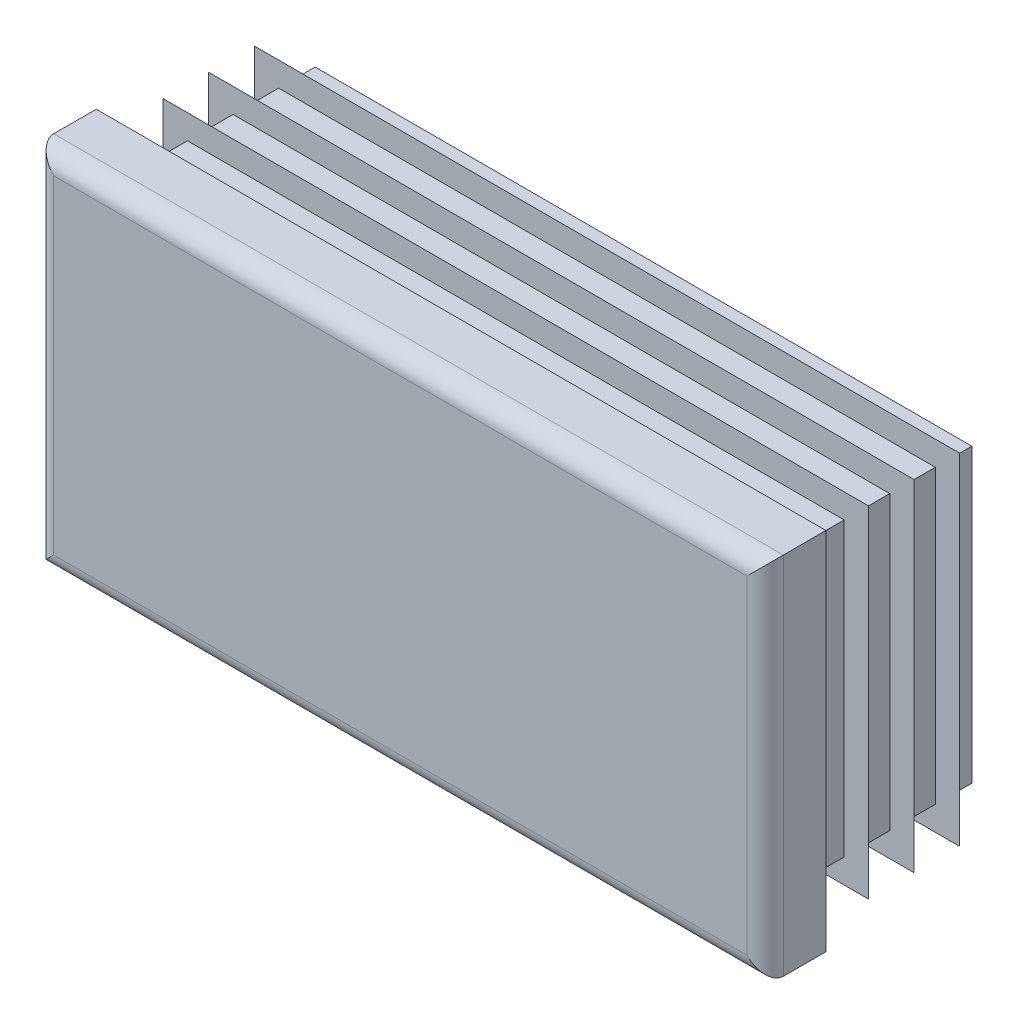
ISO-10303-21;
HEADER;
FILE_DESCRIPTION(('STEP AP214'),'2;1');
FILE_NAME('part.step','',(''),(''),'','','');
FILE_SCHEMA(('AUTOMOTIVE_DESIGN { 1 0 10303 214 1 1 1 1 }'));
ENDSEC;
DATA;
#1=APPLICATION_CONTEXT('core data for automotive mechanical design processes');
#2=APPLICATION_PROTOCOL_DEFINITION('international standard','automotive_design',2000,#1);
#3=PRODUCT_CONTEXT('',#1,'mechanical');
#4=PRODUCT('Part','Part','',(#3));
#5=PRODUCT_RELATED_PRODUCT_CATEGORY('part','',(#4));
#6=PRODUCT_DEFINITION_FORMATION('','',#4);
#7=PRODUCT_DEFINITION_CONTEXT('part definition',#1,'design');
#8=PRODUCT_DEFINITION('design','',#6,#7);
#9=PRODUCT_DEFINITION_SHAPE('','',#8);
#10=(LENGTH_UNIT() NAMED_UNIT(*) SI_UNIT(.MILLI.,.METRE.));
#11=(NAMED_UNIT(*) PLANE_ANGLE_UNIT() SI_UNIT($,.RADIAN.));
#12=(NAMED_UNIT(*) SI_UNIT($,.STERADIAN.) SOLID_ANGLE_UNIT());
#13=UNCERTAINTY_MEASURE_WITH_UNIT(LENGTH_MEASURE(1.E-05),#10,'distance_accuracy_value','');
#14=(GEOMETRIC_REPRESENTATION_CONTEXT(3) GLOBAL_UNCERTAINTY_ASSIGNED_CONTEXT((#13)) GLOBAL_UNIT_ASSIGNED_CONTEXT((#10,
#11,#12)) REPRESENTATION_CONTEXT('',''));
#15=CARTESIAN_POINT('',(0.,0.,0.));
#16=DIRECTION('',(0.,0.,1.));
#17=DIRECTION('',(1.,0.,0.));
#18=AXIS2_PLACEMENT_3D('',#15,#16,#17);
#19=CARTESIAN_POINT('',(28.5,-15.,5.));
#20=DIRECTION('',(0.,0.,-1.));
#21=DIRECTION('',(0.,1.,0.));
#22=AXIS2_PLACEMENT_3D('',#19,#20,#21);
#23=PLANE('',#22);
#24=DIRECTION('',(0.,1.,0.));
#25=VECTOR('',#24,1.);
#26=CARTESIAN_POINT('',(-28.5,-15.,5.));
#27=LINE('',#26,#25);
#28=CARTESIAN_POINT('',(-28.5,-13.5,5.));
#29=VERTEX_POINT('',#28);
#30=CARTESIAN_POINT('',(-28.5,13.5,5.));
#31=VERTEX_POINT('',#30);
#32=EDGE_CURVE('E310',#29,#31,#27,.T.);
#33=ORIENTED_EDGE('',*,*,#32,.F.);
#34=DIRECTION('',(-1.,0.,0.));
#35=VECTOR('',#34,1.);
#36=CARTESIAN_POINT('',(30.,-13.5,5.));
#37=LINE('',#36,#35);
#38=CARTESIAN_POINT('',(28.5,-13.5,5.));
#39=VERTEX_POINT('',#38);
#40=EDGE_CURVE('E482',#39,#29,#37,.T.);
#41=ORIENTED_EDGE('',*,*,#40,.F.);
#42=DIRECTION('',(0.,1.,0.));
#43=VECTOR('',#42,1.);
#44=CARTESIAN_POINT('',(28.5,-15.,5.));
#45=LINE('',#44,#43);
#46=CARTESIAN_POINT('',(28.5,13.5,5.));
#47=VERTEX_POINT('',#46);
#48=EDGE_CURVE('E305',#39,#47,#45,.T.);
#49=ORIENTED_EDGE('',*,*,#48,.T.);
#50=DIRECTION('',(-1.,0.,0.));
#51=VECTOR('',#50,1.);
#52=CARTESIAN_POINT('',(30.,13.5,5.));
#53=LINE('',#52,#51);
#54=EDGE_CURVE('E630',#47,#31,#53,.T.);
#55=ORIENTED_EDGE('',*,*,#54,.T.);
#56=EDGE_LOOP('',(#33,#41,#49,#55));
#57=FACE_BOUND('',#56,.T.);
#58=ADVANCED_FACE('F14',(#57),#23,.F.);
#59=CARTESIAN_POINT('',(-28.5,-15.,3.5));
#60=DIRECTION('',(0.,1.,0.));
#61=DIRECTION('',(-1.,0.,0.));
#62=AXIS2_PLACEMENT_3D('',#59,#60,#61);
#63=CYLINDRICAL_SURFACE('',#62,1.5);
#64=DIRECTION('',(0.,1.,0.));
#65=VECTOR('',#64,1.);
#66=CARTESIAN_POINT('',(-30.,-15.,3.5));
#67=LINE('',#66,#65);
#68=CARTESIAN_POINT('',(-30.,-15.,3.5));
#69=VERTEX_POINT('',#68);
#70=CARTESIAN_POINT('',(-30.,15.,3.5));
#71=VERTEX_POINT('',#70);
#72=EDGE_CURVE('E402',#69,#71,#67,.T.);
#73=ORIENTED_EDGE('',*,*,#72,.F.);
#74=CARTESIAN_POINT('',(-28.5,-13.5,3.5));
#75=DIRECTION('',(-0.707106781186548,0.707106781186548,0.));
#76=DIRECTION('',(0.707106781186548,0.707106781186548,0.));
#77=AXIS2_PLACEMENT_3D('',#74,#75,#76);
#78=ELLIPSE('',#77,2.12132034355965,1.5);
#79=EDGE_CURVE('E59',#69,#29,#78,.T.);
#80=ORIENTED_EDGE('',*,*,#79,.T.);
#81=ORIENTED_EDGE('',*,*,#32,.T.);
#82=CARTESIAN_POINT('',(-28.5,13.5,3.5));
#83=DIRECTION('',(0.707106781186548,0.707106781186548,0.));
#84=DIRECTION('',(-0.707106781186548,0.707106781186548,0.));
#85=AXIS2_PLACEMENT_3D('',#82,#83,#84);
#86=ELLIPSE('',#85,2.12132034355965,1.5);
#87=EDGE_CURVE('E306',#31,#71,#86,.F.);
#88=ORIENTED_EDGE('',*,*,#87,.T.);
#89=EDGE_LOOP('',(#73,#80,#81,#88));
#90=FACE_BOUND('',#89,.T.);
#91=ADVANCED_FACE('F16',(#90),#63,.T.);
#92=CARTESIAN_POINT('',(-30.,-15.,3.5));
#93=DIRECTION('',(1.,0.,0.));
#94=DIRECTION('',(0.,1.,0.));
#95=AXIS2_PLACEMENT_3D('',#92,#93,#94);
#96=PLANE('',#95);
#97=DIRECTION('',(0.,0.,-1.));
#98=VECTOR('',#97,1.);
#99=CARTESIAN_POINT('',(-30.,15.,3.5));
#100=LINE('',#99,#98);
#101=CARTESIAN_POINT('',(-30.,15.,0.));
#102=VERTEX_POINT('',#101);
#103=EDGE_CURVE('E615',#71,#102,#100,.T.);
#104=ORIENTED_EDGE('',*,*,#103,.T.);
#105=DIRECTION('',(0.,1.,0.));
#106=VECTOR('',#105,1.);
#107=CARTESIAN_POINT('',(-30.,-15.,0.));
#108=LINE('',#107,#106);
#109=CARTESIAN_POINT('',(-30.,-15.,0.));
#110=VERTEX_POINT('',#109);
#111=EDGE_CURVE('E400',#110,#102,#108,.T.);
#112=ORIENTED_EDGE('',*,*,#111,.F.);
#113=DIRECTION('',(0.,0.,-1.));
#114=VECTOR('',#113,1.);
#115=CARTESIAN_POINT('',(-30.,-15.,3.5));
#116=LINE('',#115,#114);
#117=EDGE_CURVE('E616',#69,#110,#116,.T.);
#118=ORIENTED_EDGE('',*,*,#117,.F.);
#119=ORIENTED_EDGE('',*,*,#72,.T.);
#120=EDGE_LOOP('',(#104,#112,#118,#119));
#121=FACE_BOUND('',#120,.T.);
#122=ADVANCED_FACE('F697',(#121),#96,.F.);
#123=CARTESIAN_POINT('',(-27.,-15.,0.));
#124=DIRECTION('',(1.,0.,0.));
#125=DIRECTION('',(0.,1.,0.));
#126=AXIS2_PLACEMENT_3D('',#123,#124,#125);
#127=PLANE('',#126);
#128=DIRECTION('',(0.,1.,0.));
#129=VECTOR('',#128,1.);
#130=CARTESIAN_POINT('',(-27.,-15.,0.));
#131=LINE('',#130,#129);
#132=CARTESIAN_POINT('',(-27.,-12.,0.));
#133=VERTEX_POINT('',#132);
#134=CARTESIAN_POINT('',(-27.,12.,0.));
#135=VERTEX_POINT('',#134);
#136=EDGE_CURVE('E397',#133,#135,#131,.T.);
#137=ORIENTED_EDGE('',*,*,#136,.T.);
#138=DIRECTION('',(0.,0.,-1.));
#139=VECTOR('',#138,1.);
#140=CARTESIAN_POINT('',(-27.,12.,0.));
#141=LINE('',#140,#139);
#142=CARTESIAN_POINT('',(-27.,12.,-0.75));
#143=VERTEX_POINT('',#142);
#144=EDGE_CURVE('E495',#135,#143,#141,.T.);
#145=ORIENTED_EDGE('',*,*,#144,.T.);
#146=DIRECTION('',(0.,1.,0.));
#147=VECTOR('',#146,1.);
#148=CARTESIAN_POINT('',(-27.,-15.,-0.75));
#149=LINE('',#148,#147);
#150=CARTESIAN_POINT('',(-27.,-12.,-0.75));
#151=VERTEX_POINT('',#150);
#152=EDGE_CURVE('E394',#151,#143,#149,.T.);
#153=ORIENTED_EDGE('',*,*,#152,.F.);
#154=DIRECTION('',(0.,0.,1.));
#155=VECTOR('',#154,1.);
#156=CARTESIAN_POINT('',(-27.,-12.,0.));
#157=LINE('',#156,#155);
#158=EDGE_CURVE('E489',#151,#133,#157,.T.);
#159=ORIENTED_EDGE('',*,*,#158,.T.);
#160=EDGE_LOOP('',(#137,#145,#153,#159));
#161=FACE_BOUND('',#160,.T.);
#162=ADVANCED_FACE('F787',(#161),#127,.F.);
#163=CARTESIAN_POINT('',(-29.,-15.,-0.75));
#164=DIRECTION('',(0.342020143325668,0.,0.939692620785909));
#165=DIRECTION('',(-0.939692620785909,0.,0.342020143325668));
#166=AXIS2_PLACEMENT_3D('',#163,#164,#165);
#167=PLANE('',#166);
#168=DIRECTION('',(0.,1.,0.));
#169=VECTOR('',#168,1.);
#170=CARTESIAN_POINT('',(-29.,-15.,-0.75));
#171=LINE('',#170,#169);
#172=CARTESIAN_POINT('',(-29.,-14.,-0.75));
#173=VERTEX_POINT('',#172);
#174=CARTESIAN_POINT('',(-29.,14.,-0.75));
#175=VERTEX_POINT('',#174);
#176=EDGE_CURVE('E392',#173,#175,#171,.T.);
#177=ORIENTED_EDGE('',*,*,#176,.T.);
#178=DIRECTION('',(0.844349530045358,-0.43889572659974,-0.307318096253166));
#179=VECTOR('',#178,1.);
#180=CARTESIAN_POINT('',(-18.2531393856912,8.41374569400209,-4.66153737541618));
#181=LINE('',#180,#179);
#182=CARTESIAN_POINT('',(-27.,12.9603932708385,-1.4779404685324));
#183=VERTEX_POINT('',#182);
#184=EDGE_CURVE('E519',#175,#183,#181,.T.);
#185=ORIENTED_EDGE('',*,*,#184,.T.);
#186=DIRECTION('',(0.,1.,0.));
#187=VECTOR('',#186,1.);
#188=CARTESIAN_POINT('',(-27.,-15.,-1.4779404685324));
#189=LINE('',#188,#187);
#190=CARTESIAN_POINT('',(-27.,-12.9603932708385,-1.4779404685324));
#191=VERTEX_POINT('',#190);
#192=EDGE_CURVE('E389',#191,#183,#189,.T.);
#193=ORIENTED_EDGE('',*,*,#192,.F.);
#194=DIRECTION('',(-0.844349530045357,-0.43889572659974,0.307318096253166));
#195=VECTOR('',#194,1.);
#196=CARTESIAN_POINT('',(-29.3705814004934,-14.1926294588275,-0.615119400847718));
#197=LINE('',#196,#195);
#198=EDGE_CURVE('E507',#191,#173,#197,.T.);
#199=ORIENTED_EDGE('',*,*,#198,.T.);
#200=EDGE_LOOP('',(#177,#185,#193,#199));
#201=FACE_BOUND('',#200,.T.);
#202=ADVANCED_FACE('F783',(#201),#167,.F.);
#203=CARTESIAN_POINT('',(-27.,-15.,-1.4779404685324));
#204=DIRECTION('',(1.,0.,0.));
#205=DIRECTION('',(0.,1.,0.));
#206=AXIS2_PLACEMENT_3D('',#203,#204,#205);
#207=PLANE('',#206);
#208=ORIENTED_EDGE('',*,*,#192,.T.);
#209=DIRECTION('',(0.,-0.819152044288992,-0.573576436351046));
#210=VECTOR('',#209,1.);
#211=CARTESIAN_POINT('',(-27.,-5.80131222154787,-14.6150280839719));
#212=LINE('',#211,#210);
#213=CARTESIAN_POINT('',(-27.,12.,-2.15041507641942));
#214=VERTEX_POINT('',#213);
#215=EDGE_CURVE('E516',#183,#214,#212,.T.);
#216=ORIENTED_EDGE('',*,*,#215,.T.);
#217=DIRECTION('',(0.,0.,-1.));
#218=VECTOR('',#217,1.);
#219=CARTESIAN_POINT('',(-27.,12.,-1.4779404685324));
#220=LINE('',#219,#218);
#221=CARTESIAN_POINT('',(-27.,12.,-4.5));
#222=VERTEX_POINT('',#221);
#223=EDGE_CURVE('E525',#214,#222,#220,.T.);
#224=ORIENTED_EDGE('',*,*,#223,.T.);
#225=DIRECTION('',(0.,1.,0.));
#226=VECTOR('',#225,1.);
#227=CARTESIAN_POINT('',(-27.,-15.,-4.5));
#228=LINE('',#227,#226);
#229=CARTESIAN_POINT('',(-27.,-12.,-4.5));
#230=VERTEX_POINT('',#229);
#231=EDGE_CURVE('E386',#230,#222,#228,.T.);
#232=ORIENTED_EDGE('',*,*,#231,.F.);
#233=DIRECTION('',(0.,0.,1.));
#234=VECTOR('',#233,1.);
#235=CARTESIAN_POINT('',(-27.,-12.,-1.4779404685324));
#236=LINE('',#235,#234);
#237=CARTESIAN_POINT('',(-27.,-12.,-2.15041507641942));
#238=VERTEX_POINT('',#237);
#239=EDGE_CURVE('E522',#230,#238,#236,.T.);
#240=ORIENTED_EDGE('',*,*,#239,.T.);
#241=DIRECTION('',(0.,-0.819152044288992,0.573576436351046));
#242=VECTOR('',#241,1.);
#243=CARTESIAN_POINT('',(-27.,-14.3289899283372,-0.519638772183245));
#244=LINE('',#243,#242);
#245=EDGE_CURVE('E504',#238,#191,#244,.T.);
#246=ORIENTED_EDGE('',*,*,#245,.T.);
#247=EDGE_LOOP('',(#208,#216,#224,#232,#240,#246));
#248=FACE_BOUND('',#247,.T.);
#249=ADVANCED_FACE('F779',(#248),#207,.F.);
#250=CARTESIAN_POINT('',(-29.,-15.,-4.5));
#251=DIRECTION('',(0.342020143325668,0.,0.939692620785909));
#252=DIRECTION('',(-0.939692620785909,0.,0.342020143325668));
#253=AXIS2_PLACEMENT_3D('',#250,#251,#252);
#254=PLANE('',#253);
#255=DIRECTION('',(0.,1.,0.));
#256=VECTOR('',#255,1.);
#257=CARTESIAN_POINT('',(-29.,-15.,-4.5));
#258=LINE('',#257,#256);
#259=CARTESIAN_POINT('',(-29.,-14.,-4.5));
#260=VERTEX_POINT('',#259);
#261=CARTESIAN_POINT('',(-29.,14.,-4.5));
#262=VERTEX_POINT('',#261);
#263=EDGE_CURVE('E384',#260,#262,#258,.T.);
#264=ORIENTED_EDGE('',*,*,#263,.T.);
#265=DIRECTION('',(0.844349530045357,-0.43889572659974,-0.307318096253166));
#266=VECTOR('',#265,1.);
#267=CARTESIAN_POINT('',(-18.2531393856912,8.41374569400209,-8.41153737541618));
#268=LINE('',#267,#266);
#269=CARTESIAN_POINT('',(-27.,12.9603932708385,-5.2279404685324));
#270=VERTEX_POINT('',#269);
#271=EDGE_CURVE('E549',#262,#270,#268,.T.);
#272=ORIENTED_EDGE('',*,*,#271,.T.);
#273=DIRECTION('',(0.,1.,0.));
#274=VECTOR('',#273,1.);
#275=CARTESIAN_POINT('',(-27.,-15.,-5.2279404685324));
#276=LINE('',#275,#274);
#277=CARTESIAN_POINT('',(-27.,-12.9603932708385,-5.2279404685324));
#278=VERTEX_POINT('',#277);
#279=EDGE_CURVE('E381',#278,#270,#276,.T.);
#280=ORIENTED_EDGE('',*,*,#279,.F.);
#281=DIRECTION('',(-0.844349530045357,-0.43889572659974,0.307318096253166));
#282=VECTOR('',#281,1.);
#283=CARTESIAN_POINT('',(-29.3705814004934,-14.1926294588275,-4.36511940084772));
#284=LINE('',#283,#282);
#285=EDGE_CURVE('E537',#278,#260,#284,.T.);
#286=ORIENTED_EDGE('',*,*,#285,.T.);
#287=EDGE_LOOP('',(#264,#272,#280,#286));
#288=FACE_BOUND('',#287,.T.);
#289=ADVANCED_FACE('F775',(#288),#254,.F.);
#290=CARTESIAN_POINT('',(-27.,-15.,-5.2279404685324));
#291=DIRECTION('',(1.,0.,0.));
#292=DIRECTION('',(0.,1.,0.));
#293=AXIS2_PLACEMENT_3D('',#290,#291,#292);
#294=PLANE('',#293);
#295=ORIENTED_EDGE('',*,*,#279,.T.);
#296=DIRECTION('',(0.,-0.819152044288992,-0.573576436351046));
#297=VECTOR('',#296,1.);
#298=CARTESIAN_POINT('',(-27.,-5.80131222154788,-18.3650280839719));
#299=LINE('',#298,#297);
#300=CARTESIAN_POINT('',(-27.,12.,-5.90041507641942));
#301=VERTEX_POINT('',#300);
#302=EDGE_CURVE('E546',#270,#301,#299,.T.);
#303=ORIENTED_EDGE('',*,*,#302,.T.);
#304=DIRECTION('',(0.,0.,-1.));
#305=VECTOR('',#304,1.);
#306=CARTESIAN_POINT('',(-27.,12.,-5.2279404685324));
#307=LINE('',#306,#305);
#308=CARTESIAN_POINT('',(-27.,12.,-8.25));
#309=VERTEX_POINT('',#308);
#310=EDGE_CURVE('E555',#301,#309,#307,.T.);
#311=ORIENTED_EDGE('',*,*,#310,.T.);
#312=DIRECTION('',(0.,1.,0.));
#313=VECTOR('',#312,1.);
#314=CARTESIAN_POINT('',(-27.,-15.,-8.25));
#315=LINE('',#314,#313);
#316=CARTESIAN_POINT('',(-27.,-12.,-8.25));
#317=VERTEX_POINT('',#316);
#318=EDGE_CURVE('E378',#317,#309,#315,.T.);
#319=ORIENTED_EDGE('',*,*,#318,.F.);
#320=DIRECTION('',(0.,0.,1.));
#321=VECTOR('',#320,1.);
#322=CARTESIAN_POINT('',(-27.,-12.,-5.2279404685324));
#323=LINE('',#322,#321);
#324=CARTESIAN_POINT('',(-27.,-12.,-5.90041507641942));
#325=VERTEX_POINT('',#324);
#326=EDGE_CURVE('E552',#317,#325,#323,.T.);
#327=ORIENTED_EDGE('',*,*,#326,.T.);
#328=DIRECTION('',(0.,-0.819152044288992,0.573576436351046));
#329=VECTOR('',#328,1.);
#330=CARTESIAN_POINT('',(-27.,-14.3289899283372,-4.26963877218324));
#331=LINE('',#330,#329);
#332=EDGE_CURVE('E534',#325,#278,#331,.T.);
#333=ORIENTED_EDGE('',*,*,#332,.T.);
#334=EDGE_LOOP('',(#295,#303,#311,#319,#327,#333));
#335=FACE_BOUND('',#334,.T.);
#336=ADVANCED_FACE('F771',(#335),#294,.F.);
#337=CARTESIAN_POINT('',(-29.,-15.,-8.25));
#338=DIRECTION('',(0.342020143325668,0.,0.939692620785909));
#339=DIRECTION('',(-0.939692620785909,0.,0.342020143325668));
#340=AXIS2_PLACEMENT_3D('',#337,#338,#339);
#341=PLANE('',#340);
#342=DIRECTION('',(0.,1.,0.));
#343=VECTOR('',#342,1.);
#344=CARTESIAN_POINT('',(-29.,-15.,-8.25));
#345=LINE('',#344,#343);
#346=CARTESIAN_POINT('',(-29.,-14.,-8.25));
#347=VERTEX_POINT('',#346);
#348=CARTESIAN_POINT('',(-29.,14.,-8.25));
#349=VERTEX_POINT('',#348);
#350=EDGE_CURVE('E376',#347,#349,#345,.T.);
#351=ORIENTED_EDGE('',*,*,#350,.T.);
#352=DIRECTION('',(0.844349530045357,-0.43889572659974,-0.307318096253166));
#353=VECTOR('',#352,1.);
#354=CARTESIAN_POINT('',(-18.2531393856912,8.41374569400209,-12.1615373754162));
#355=LINE('',#354,#353);
#356=CARTESIAN_POINT('',(-27.,12.9603932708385,-8.97794046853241));
#357=VERTEX_POINT('',#356);
#358=EDGE_CURVE('E579',#349,#357,#355,.T.);
#359=ORIENTED_EDGE('',*,*,#358,.T.);
#360=DIRECTION('',(0.,1.,0.));
#361=VECTOR('',#360,1.);
#362=CARTESIAN_POINT('',(-27.,-15.,-8.9779404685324));
#363=LINE('',#362,#361);
#364=CARTESIAN_POINT('',(-27.,-12.9603932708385,-8.9779404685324));
#365=VERTEX_POINT('',#364);
#366=EDGE_CURVE('E373',#365,#357,#363,.T.);
#367=ORIENTED_EDGE('',*,*,#366,.F.);
#368=DIRECTION('',(-0.844349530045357,-0.438895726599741,0.307318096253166));
#369=VECTOR('',#368,1.);
#370=CARTESIAN_POINT('',(-29.3705814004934,-14.1926294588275,-8.11511940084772));
#371=LINE('',#370,#369);
#372=EDGE_CURVE('E567',#365,#347,#371,.T.);
#373=ORIENTED_EDGE('',*,*,#372,.T.);
#374=EDGE_LOOP('',(#351,#359,#367,#373));
#375=FACE_BOUND('',#374,.T.);
#376=ADVANCED_FACE('F767',(#375),#341,.F.);
#377=CARTESIAN_POINT('',(-27.,-15.,-8.9779404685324));
#378=DIRECTION('',(1.,0.,0.));
#379=DIRECTION('',(0.,1.,0.));
#380=AXIS2_PLACEMENT_3D('',#377,#378,#379);
#381=PLANE('',#380);
#382=ORIENTED_EDGE('',*,*,#366,.T.);
#383=DIRECTION('',(0.,-0.819152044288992,-0.573576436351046));
#384=VECTOR('',#383,1.);
#385=CARTESIAN_POINT('',(-27.,-5.80131222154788,-22.1150280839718));
#386=LINE('',#385,#384);
#387=CARTESIAN_POINT('',(-27.,12.,-9.65041507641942));
#388=VERTEX_POINT('',#387);
#389=EDGE_CURVE('E576',#357,#388,#386,.T.);
#390=ORIENTED_EDGE('',*,*,#389,.T.);
#391=DIRECTION('',(0.,0.,-1.));
#392=VECTOR('',#391,1.);
#393=CARTESIAN_POINT('',(-27.,12.,-8.9779404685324));
#394=LINE('',#393,#392);
#395=CARTESIAN_POINT('',(-27.,12.,-12.));
#396=VERTEX_POINT('',#395);
#397=EDGE_CURVE('E585',#388,#396,#394,.T.);
#398=ORIENTED_EDGE('',*,*,#397,.T.);
#399=DIRECTION('',(0.,1.,0.));
#400=VECTOR('',#399,1.);
#401=CARTESIAN_POINT('',(-27.,-15.,-12.));
#402=LINE('',#401,#400);
#403=CARTESIAN_POINT('',(-27.,-12.,-12.));
#404=VERTEX_POINT('',#403);
#405=EDGE_CURVE('E370',#404,#396,#402,.T.);
#406=ORIENTED_EDGE('',*,*,#405,.F.);
#407=DIRECTION('',(0.,0.,1.));
#408=VECTOR('',#407,1.);
#409=CARTESIAN_POINT('',(-27.,-12.,-8.9779404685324));
#410=LINE('',#409,#408);
#411=CARTESIAN_POINT('',(-27.,-12.,-9.65041507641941));
#412=VERTEX_POINT('',#411);
#413=EDGE_CURVE('E582',#404,#412,#410,.T.);
#414=ORIENTED_EDGE('',*,*,#413,.T.);
#415=DIRECTION('',(0.,-0.819152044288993,0.573576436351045));
#416=VECTOR('',#415,1.);
#417=CARTESIAN_POINT('',(-27.,-14.3289899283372,-8.01963877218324));
#418=LINE('',#417,#416);
#419=EDGE_CURVE('E564',#412,#365,#418,.T.);
#420=ORIENTED_EDGE('',*,*,#419,.T.);
#421=EDGE_LOOP('',(#382,#390,#398,#406,#414,#420));
#422=FACE_BOUND('',#421,.T.);
#423=ADVANCED_FACE('F764',(#422),#381,.F.);
#424=CARTESIAN_POINT('',(-29.,-15.,-12.));
#425=DIRECTION('',(0.342020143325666,0.,0.939692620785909));
#426=DIRECTION('',(-0.939692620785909,0.,0.342020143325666));
#427=AXIS2_PLACEMENT_3D('',#424,#425,#426);
#428=PLANE('',#427);
#429=DIRECTION('',(0.,1.,0.));
#430=VECTOR('',#429,1.);
#431=CARTESIAN_POINT('',(-29.,-15.,-12.));
#432=LINE('',#431,#430);
#433=CARTESIAN_POINT('',(-29.,-14.,-12.));
#434=VERTEX_POINT('',#433);
#435=CARTESIAN_POINT('',(-29.,14.,-12.));
#436=VERTEX_POINT('',#435);
#437=EDGE_CURVE('E368',#434,#436,#432,.T.);
#438=ORIENTED_EDGE('',*,*,#437,.T.);
#439=DIRECTION('',(0.844349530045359,-0.438895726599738,-0.307318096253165));
#440=VECTOR('',#439,1.);
#441=CARTESIAN_POINT('',(-18.2531393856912,8.41374569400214,-15.9115373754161));
#442=LINE('',#441,#440);
#443=CARTESIAN_POINT('',(-27.,12.9603932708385,-12.7279404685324));
#444=VERTEX_POINT('',#443);
#445=EDGE_CURVE('E607',#436,#444,#442,.T.);
#446=ORIENTED_EDGE('',*,*,#445,.T.);
#447=DIRECTION('',(0.,1.,0.));
#448=VECTOR('',#447,1.);
#449=CARTESIAN_POINT('',(-27.,-15.,-12.7279404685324));
#450=LINE('',#449,#448);
#451=CARTESIAN_POINT('',(-27.,-12.9603932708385,-12.7279404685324));
#452=VERTEX_POINT('',#451);
#453=EDGE_CURVE('E365',#452,#444,#450,.T.);
#454=ORIENTED_EDGE('',*,*,#453,.F.);
#455=DIRECTION('',(-0.844349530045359,-0.438895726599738,0.307318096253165));
#456=VECTOR('',#455,1.);
#457=CARTESIAN_POINT('',(-29.3705814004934,-14.1926294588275,-11.8651194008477));
#458=LINE('',#457,#456);
#459=EDGE_CURVE('E595',#452,#434,#458,.T.);
#460=ORIENTED_EDGE('',*,*,#459,.T.);
#461=EDGE_LOOP('',(#438,#446,#454,#460));
#462=FACE_BOUND('',#461,.T.);
#463=ADVANCED_FACE('F675',(#462),#428,.F.);
#464=CARTESIAN_POINT('',(-27.,-15.,-12.7279404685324));
#465=DIRECTION('',(1.,0.,0.));
#466=DIRECTION('',(0.,1.,0.));
#467=AXIS2_PLACEMENT_3D('',#464,#465,#466);
#468=PLANE('',#467);
#469=ORIENTED_EDGE('',*,*,#453,.T.);
#470=DIRECTION('',(0.,-0.819152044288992,-0.573576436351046));
#471=VECTOR('',#470,1.);
#472=CARTESIAN_POINT('',(-27.,-5.80131222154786,-25.8650280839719));
#473=LINE('',#472,#471);
#474=CARTESIAN_POINT('',(-27.,12.,-13.4004150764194));
#475=VERTEX_POINT('',#474);
#476=EDGE_CURVE('E604',#444,#475,#473,.T.);
#477=ORIENTED_EDGE('',*,*,#476,.T.);
#478=DIRECTION('',(0.,0.,-1.));
#479=VECTOR('',#478,1.);
#480=CARTESIAN_POINT('',(-27.,12.,-12.7279404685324));
#481=LINE('',#480,#479);
#482=CARTESIAN_POINT('',(-27.,12.,-15.));
#483=VERTEX_POINT('',#482);
#484=EDGE_CURVE('E613',#475,#483,#481,.T.);
#485=ORIENTED_EDGE('',*,*,#484,.T.);
#486=DIRECTION('',(0.,1.,0.));
#487=VECTOR('',#486,1.);
#488=CARTESIAN_POINT('',(-27.,-15.,-15.));
#489=LINE('',#488,#487);
#490=CARTESIAN_POINT('',(-27.,-12.,-15.));
#491=VERTEX_POINT('',#490);
#492=EDGE_CURVE('E362',#491,#483,#489,.T.);
#493=ORIENTED_EDGE('',*,*,#492,.F.);
#494=DIRECTION('',(0.,0.,1.));
#495=VECTOR('',#494,1.);
#496=CARTESIAN_POINT('',(-27.,-12.,-12.7279404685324));
#497=LINE('',#496,#495);
#498=CARTESIAN_POINT('',(-27.,-12.,-13.4004150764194));
#499=VERTEX_POINT('',#498);
#500=EDGE_CURVE('E610',#491,#499,#497,.T.);
#501=ORIENTED_EDGE('',*,*,#500,.T.);
#502=DIRECTION('',(0.,-0.819152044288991,0.573576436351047));
#503=VECTOR('',#502,1.);
#504=CARTESIAN_POINT('',(-27.,-14.3289899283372,-11.7696387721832));
#505=LINE('',#504,#503);
#506=EDGE_CURVE('E592',#499,#452,#505,.T.);
#507=ORIENTED_EDGE('',*,*,#506,.T.);
#508=EDGE_LOOP('',(#469,#477,#485,#493,#501,#507));
#509=FACE_BOUND('',#508,.T.);
#510=ADVANCED_FACE('F677',(#509),#468,.F.);
#511=CARTESIAN_POINT('',(-27.,-15.,-15.));
#512=DIRECTION('',(0.,0.,1.));
#513=DIRECTION('',(0.,-1.,0.));
#514=AXIS2_PLACEMENT_3D('',#511,#512,#513);
#515=PLANE('',#514);
#516=ORIENTED_EDGE('',*,*,#492,.T.);
#517=DIRECTION('',(-1.,0.,0.));
#518=VECTOR('',#517,1.);
#519=CARTESIAN_POINT('',(30.,12.,-15.));
#520=LINE('',#519,#518);
#521=CARTESIAN_POINT('',(27.,12.,-15.));
#522=VERTEX_POINT('',#521);
#523=EDGE_CURVE('E438',#522,#483,#520,.T.);
#524=ORIENTED_EDGE('',*,*,#523,.F.);
#525=DIRECTION('',(0.,1.,0.));
#526=VECTOR('',#525,1.);
#527=CARTESIAN_POINT('',(27.,-15.,-15.));
#528=LINE('',#527,#526);
#529=CARTESIAN_POINT('',(27.,-12.,-15.));
#530=VERTEX_POINT('',#529);
#531=EDGE_CURVE('E359',#530,#522,#528,.T.);
#532=ORIENTED_EDGE('',*,*,#531,.F.);
#533=DIRECTION('',(-1.,0.,0.));
#534=VECTOR('',#533,1.);
#535=CARTESIAN_POINT('',(30.,-12.,-15.));
#536=LINE('',#535,#534);
#537=EDGE_CURVE('E436',#530,#491,#536,.T.);
#538=ORIENTED_EDGE('',*,*,#537,.T.);
#539=EDGE_LOOP('',(#516,#524,#532,#538));
#540=FACE_BOUND('',#539,.T.);
#541=ADVANCED_FACE('F435',(#540),#515,.F.);
#542=CARTESIAN_POINT('',(27.,-15.,-15.));
#543=DIRECTION('',(-1.,0.,0.));
#544=DIRECTION('',(0.,-1.,0.));
#545=AXIS2_PLACEMENT_3D('',#542,#543,#544);
#546=PLANE('',#545);
#547=DIRECTION('',(0.,0.,1.));
#548=VECTOR('',#547,1.);
#549=CARTESIAN_POINT('',(27.,12.,-15.));
#550=LINE('',#549,#548);
#551=CARTESIAN_POINT('',(27.,12.,-13.4004150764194));
#552=VERTEX_POINT('',#551);
#553=EDGE_CURVE('E9',#522,#552,#550,.T.);
#554=ORIENTED_EDGE('',*,*,#553,.T.);
#555=DIRECTION('',(0.,0.819152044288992,0.573576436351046));
#556=VECTOR('',#555,1.);
#557=CARTESIAN_POINT('',(27.,-6.86883100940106,-26.6125127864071));
#558=LINE('',#557,#556);
#559=CARTESIAN_POINT('',(27.,12.9603932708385,-12.7279404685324));
#560=VERTEX_POINT('',#559);
#561=EDGE_CURVE('E601',#552,#560,#558,.T.);
#562=ORIENTED_EDGE('',*,*,#561,.T.);
#563=DIRECTION('',(0.,1.,0.));
#564=VECTOR('',#563,1.);
#565=CARTESIAN_POINT('',(27.,-15.,-12.7279404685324));
#566=LINE('',#565,#564);
#567=CARTESIAN_POINT('',(27.,-12.9603932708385,-12.7279404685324));
#568=VERTEX_POINT('',#567);
#569=EDGE_CURVE('E356',#568,#560,#566,.T.);
#570=ORIENTED_EDGE('',*,*,#569,.F.);
#571=DIRECTION('',(0.,0.819152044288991,-0.573576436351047));
#572=VECTOR('',#571,1.);
#573=CARTESIAN_POINT('',(27.,-13.261471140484,-12.5171234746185));
#574=LINE('',#573,#572);
#575=CARTESIAN_POINT('',(27.,-12.,-13.4004150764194));
#576=VERTEX_POINT('',#575);
#577=EDGE_CURVE('E428',#568,#576,#574,.T.);
#578=ORIENTED_EDGE('',*,*,#577,.T.);
#579=DIRECTION('',(0.,0.,-1.));
#580=VECTOR('',#579,1.);
#581=CARTESIAN_POINT('',(27.,-12.,-15.));
#582=LINE('',#581,#580);
#583=EDGE_CURVE('E23',#576,#530,#582,.T.);
#584=ORIENTED_EDGE('',*,*,#583,.T.);
#585=ORIENTED_EDGE('',*,*,#531,.T.);
#586=EDGE_LOOP('',(#554,#562,#570,#578,#584,#585));
#587=FACE_BOUND('',#586,.T.);
#588=ADVANCED_FACE('F426',(#587),#546,.F.);
#589=CARTESIAN_POINT('',(27.,-15.,-12.7279404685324));
#590=DIRECTION('',(-0.342020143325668,0.,0.939692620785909));
#591=DIRECTION('',(-0.939692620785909,0.,-0.342020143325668));
#592=AXIS2_PLACEMENT_3D('',#589,#590,#591);
#593=PLANE('',#592);
#594=ORIENTED_EDGE('',*,*,#569,.T.);
#595=DIRECTION('',(0.844349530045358,0.43889572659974,0.307318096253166));
#596=VECTOR('',#595,1.);
#597=CARTESIAN_POINT('',(16.6383983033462,7.57439784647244,-16.4992550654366));
#598=LINE('',#597,#596);
#599=CARTESIAN_POINT('',(29.,14.,-12.));
#600=VERTEX_POINT('',#599);
#601=EDGE_CURVE('E598',#560,#600,#598,.T.);
#602=ORIENTED_EDGE('',*,*,#601,.T.);
#603=DIRECTION('',(0.,1.,0.));
#604=VECTOR('',#603,1.);
#605=CARTESIAN_POINT('',(29.,-15.,-12.));
#606=LINE('',#605,#604);
#607=CARTESIAN_POINT('',(29.,-14.,-12.));
#608=VERTEX_POINT('',#607);
#609=EDGE_CURVE('E353',#608,#600,#606,.T.);
#610=ORIENTED_EDGE('',*,*,#609,.F.);
#611=DIRECTION('',(-0.844349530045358,0.438895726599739,-0.307318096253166));
#612=VECTOR('',#611,1.);
#613=CARTESIAN_POINT('',(27.7558403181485,-13.3532816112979,-12.4528370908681));
#614=LINE('',#613,#612);
#615=EDGE_CURVE('E588',#608,#568,#614,.T.);
#616=ORIENTED_EDGE('',*,*,#615,.T.);
#617=EDGE_LOOP('',(#594,#602,#610,#616));
#618=FACE_BOUND('',#617,.T.);
#619=ADVANCED_FACE('F752',(#618),#593,.F.);
#620=CARTESIAN_POINT('',(29.,-15.,-12.));
#621=DIRECTION('',(0.,0.,-1.));
#622=DIRECTION('',(0.,1.,0.));
#623=AXIS2_PLACEMENT_3D('',#620,#621,#622);
#624=PLANE('',#623);
#625=ORIENTED_EDGE('',*,*,#609,.T.);
#626=DIRECTION('',(-1.,0.,0.));
#627=VECTOR('',#626,1.);
#628=CARTESIAN_POINT('',(30.,14.,-12.));
#629=LINE('',#628,#627);
#630=EDGE_CURVE('E444',#600,#436,#629,.T.);
#631=ORIENTED_EDGE('',*,*,#630,.T.);
#632=ORIENTED_EDGE('',*,*,#437,.F.);
#633=DIRECTION('',(-1.,0.,0.));
#634=VECTOR('',#633,1.);
#635=CARTESIAN_POINT('',(30.,-14.,-12.));
#636=LINE('',#635,#634);
#637=EDGE_CURVE('E451',#608,#434,#636,.T.);
#638=ORIENTED_EDGE('',*,*,#637,.F.);
#639=EDGE_LOOP('',(#625,#631,#632,#638));
#640=FACE_BOUND('',#639,.T.);
#641=ORIENTED_EDGE('',*,*,#405,.T.);
#642=DIRECTION('',(-1.,0.,0.));
#643=VECTOR('',#642,1.);
#644=CARTESIAN_POINT('',(30.,12.,-12.));
#645=LINE('',#644,#643);
#646=CARTESIAN_POINT('',(27.,12.,-12.));
#647=VERTEX_POINT('',#646);
#648=EDGE_CURVE('E663',#647,#396,#645,.T.);
#649=ORIENTED_EDGE('',*,*,#648,.F.);
#650=DIRECTION('',(0.,1.,0.));
#651=VECTOR('',#650,1.);
#652=CARTESIAN_POINT('',(27.,-15.,-12.));
#653=LINE('',#652,#651);
#654=CARTESIAN_POINT('',(27.,-12.,-12.));
#655=VERTEX_POINT('',#654);
#656=EDGE_CURVE('E350',#655,#647,#653,.T.);
#657=ORIENTED_EDGE('',*,*,#656,.F.);
#658=DIRECTION('',(-1.,0.,0.));
#659=VECTOR('',#658,1.);
#660=CARTESIAN_POINT('',(30.,-12.,-12.));
#661=LINE('',#660,#659);
#662=EDGE_CURVE('E453',#655,#404,#661,.T.);
#663=ORIENTED_EDGE('',*,*,#662,.T.);
#664=EDGE_LOOP('',(#641,#649,#657,#663));
#665=FACE_BOUND('',#664,.T.);
#666=ADVANCED_FACE('F667',(#640,#665),#624,.F.);
#667=CARTESIAN_POINT('',(27.,-15.,-12.));
#668=DIRECTION('',(-1.,0.,0.));
#669=DIRECTION('',(0.,-1.,0.));
#670=AXIS2_PLACEMENT_3D('',#667,#668,#669);
#671=PLANE('',#670);
#672=DIRECTION('',(0.,0.,1.));
#673=VECTOR('',#672,1.);
#674=CARTESIAN_POINT('',(27.,12.,-12.));
#675=LINE('',#674,#673);
#676=CARTESIAN_POINT('',(27.,12.,-9.65041507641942));
#677=VERTEX_POINT('',#676);
#678=EDGE_CURVE('E420',#647,#677,#675,.T.);
#679=ORIENTED_EDGE('',*,*,#678,.T.);
#680=DIRECTION('',(0.,0.819152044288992,0.573576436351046));
#681=VECTOR('',#680,1.);
#682=CARTESIAN_POINT('',(27.,-7.22121574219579,-23.1092552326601));
#683=LINE('',#682,#681);
#684=CARTESIAN_POINT('',(27.,12.9603932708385,-8.9779404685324));
#685=VERTEX_POINT('',#684);
#686=EDGE_CURVE('E573',#677,#685,#683,.T.);
#687=ORIENTED_EDGE('',*,*,#686,.T.);
#688=DIRECTION('',(0.,1.,0.));
#689=VECTOR('',#688,1.);
#690=CARTESIAN_POINT('',(27.,-15.,-8.9779404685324));
#691=LINE('',#690,#689);
#692=CARTESIAN_POINT('',(27.,-12.9603932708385,-8.9779404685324));
#693=VERTEX_POINT('',#692);
#694=EDGE_CURVE('E347',#693,#685,#691,.T.);
#695=ORIENTED_EDGE('',*,*,#694,.F.);
#696=DIRECTION('',(0.,0.819152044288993,-0.573576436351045));
#697=VECTOR('',#696,1.);
#698=CARTESIAN_POINT('',(27.,-12.9090864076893,-9.01386592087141));
#699=LINE('',#698,#697);
#700=CARTESIAN_POINT('',(27.,-12.,-9.65041507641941));
#701=VERTEX_POINT('',#700);
#702=EDGE_CURVE('E561',#693,#701,#699,.T.);
#703=ORIENTED_EDGE('',*,*,#702,.T.);
#704=DIRECTION('',(0.,0.,-1.));
#705=VECTOR('',#704,1.);
#706=CARTESIAN_POINT('',(27.,-12.,-12.));
#707=LINE('',#706,#705);
#708=EDGE_CURVE('E417',#701,#655,#707,.T.);
#709=ORIENTED_EDGE('',*,*,#708,.T.);
#710=ORIENTED_EDGE('',*,*,#656,.T.);
#711=EDGE_LOOP('',(#679,#687,#695,#703,#709,#710));
#712=FACE_BOUND('',#711,.T.);
#713=ADVANCED_FACE('F745',(#712),#671,.F.);
#714=CARTESIAN_POINT('',(27.,-15.,-8.9779404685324));
#715=DIRECTION('',(-0.342020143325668,0.,0.939692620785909));
#716=DIRECTION('',(-0.939692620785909,0.,-0.342020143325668));
#717=AXIS2_PLACEMENT_3D('',#714,#715,#716);
#718=PLANE('',#717);
#719=ORIENTED_EDGE('',*,*,#694,.T.);
#720=DIRECTION('',(0.844349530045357,0.43889572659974,0.307318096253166));
#721=VECTOR('',#720,1.);
#722=CARTESIAN_POINT('',(16.6383983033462,7.57439784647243,-12.7492550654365));
#723=LINE('',#722,#721);
#724=CARTESIAN_POINT('',(29.,14.,-8.25));
#725=VERTEX_POINT('',#724);
#726=EDGE_CURVE('E570',#685,#725,#723,.T.);
#727=ORIENTED_EDGE('',*,*,#726,.T.);
#728=DIRECTION('',(0.,1.,0.));
#729=VECTOR('',#728,1.);
#730=CARTESIAN_POINT('',(29.,-15.,-8.25));
#731=LINE('',#730,#729);
#732=CARTESIAN_POINT('',(29.,-14.,-8.25));
#733=VERTEX_POINT('',#732);
#734=EDGE_CURVE('E344',#733,#725,#731,.T.);
#735=ORIENTED_EDGE('',*,*,#734,.F.);
#736=DIRECTION('',(-0.844349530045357,0.438895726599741,-0.307318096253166));
#737=VECTOR('',#736,1.);
#738=CARTESIAN_POINT('',(27.7558403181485,-13.3532816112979,-8.70283709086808));
#739=LINE('',#738,#737);
#740=EDGE_CURVE('E558',#733,#693,#739,.T.);
#741=ORIENTED_EDGE('',*,*,#740,.T.);
#742=EDGE_LOOP('',(#719,#727,#735,#741));
#743=FACE_BOUND('',#742,.T.);
#744=ADVANCED_FACE('F741',(#743),#718,.F.);
#745=CARTESIAN_POINT('',(29.,-15.,-8.25));
#746=DIRECTION('',(0.,0.,-1.));
#747=DIRECTION('',(0.,1.,0.));
#748=AXIS2_PLACEMENT_3D('',#745,#746,#747);
#749=PLANE('',#748);
#750=ORIENTED_EDGE('',*,*,#734,.T.);
#751=DIRECTION('',(-1.,0.,0.));
#752=VECTOR('',#751,1.);
#753=CARTESIAN_POINT('',(30.,14.,-8.25));
#754=LINE('',#753,#752);
#755=EDGE_CURVE('E657',#725,#349,#754,.T.);
#756=ORIENTED_EDGE('',*,*,#755,.T.);
#757=ORIENTED_EDGE('',*,*,#350,.F.);
#758=DIRECTION('',(-1.,0.,0.));
#759=VECTOR('',#758,1.);
#760=CARTESIAN_POINT('',(30.,-14.,-8.25));
#761=LINE('',#760,#759);
#762=EDGE_CURVE('E459',#733,#347,#761,.T.);
#763=ORIENTED_EDGE('',*,*,#762,.F.);
#764=EDGE_LOOP('',(#750,#756,#757,#763));
#765=FACE_BOUND('',#764,.T.);
#766=ORIENTED_EDGE('',*,*,#318,.T.);
#767=DIRECTION('',(-1.,0.,0.));
#768=VECTOR('',#767,1.);
#769=CARTESIAN_POINT('',(30.,12.,-8.25));
#770=LINE('',#769,#768);
#771=CARTESIAN_POINT('',(27.,12.,-8.25));
#772=VERTEX_POINT('',#771);
#773=EDGE_CURVE('E655',#772,#309,#770,.T.);
#774=ORIENTED_EDGE('',*,*,#773,.F.);
#775=DIRECTION('',(0.,1.,0.));
#776=VECTOR('',#775,1.);
#777=CARTESIAN_POINT('',(27.,-15.,-8.25));
#778=LINE('',#777,#776);
#779=CARTESIAN_POINT('',(27.,-12.,-8.25));
#780=VERTEX_POINT('',#779);
#781=EDGE_CURVE('E341',#780,#772,#778,.T.);
#782=ORIENTED_EDGE('',*,*,#781,.F.);
#783=DIRECTION('',(-1.,0.,0.));
#784=VECTOR('',#783,1.);
#785=CARTESIAN_POINT('',(30.,-12.,-8.25));
#786=LINE('',#785,#784);
#787=EDGE_CURVE('E461',#780,#317,#786,.T.);
#788=ORIENTED_EDGE('',*,*,#787,.T.);
#789=EDGE_LOOP('',(#766,#774,#782,#788));
#790=FACE_BOUND('',#789,.T.);
#791=ADVANCED_FACE('F737',(#765,#790),#749,.F.);
#792=CARTESIAN_POINT('',(27.,-15.,-8.25));
#793=DIRECTION('',(-1.,0.,0.));
#794=DIRECTION('',(0.,-1.,0.));
#795=AXIS2_PLACEMENT_3D('',#792,#793,#794);
#796=PLANE('',#795);
#797=DIRECTION('',(0.,0.,1.));
#798=VECTOR('',#797,1.);
#799=CARTESIAN_POINT('',(27.,12.,-8.25));
#800=LINE('',#799,#798);
#801=CARTESIAN_POINT('',(27.,12.,-5.90041507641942));
#802=VERTEX_POINT('',#801);
#803=EDGE_CURVE('E414',#772,#802,#800,.T.);
#804=ORIENTED_EDGE('',*,*,#803,.T.);
#805=DIRECTION('',(0.,0.819152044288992,0.573576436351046));
#806=VECTOR('',#805,1.);
#807=CARTESIAN_POINT('',(27.,-7.22121574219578,-19.3592552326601));
#808=LINE('',#807,#806);
#809=CARTESIAN_POINT('',(27.,12.9603932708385,-5.2279404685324));
#810=VERTEX_POINT('',#809);
#811=EDGE_CURVE('E543',#802,#810,#808,.T.);
#812=ORIENTED_EDGE('',*,*,#811,.T.);
#813=DIRECTION('',(0.,1.,0.));
#814=VECTOR('',#813,1.);
#815=CARTESIAN_POINT('',(27.,-15.,-5.2279404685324));
#816=LINE('',#815,#814);
#817=CARTESIAN_POINT('',(27.,-12.9603932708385,-5.22794046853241));
#818=VERTEX_POINT('',#817);
#819=EDGE_CURVE('E338',#818,#810,#816,.T.);
#820=ORIENTED_EDGE('',*,*,#819,.F.);
#821=DIRECTION('',(0.,0.819152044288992,-0.573576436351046));
#822=VECTOR('',#821,1.);
#823=CARTESIAN_POINT('',(27.,-12.9090864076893,-5.26386592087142));
#824=LINE('',#823,#822);
#825=CARTESIAN_POINT('',(27.,-12.,-5.90041507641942));
#826=VERTEX_POINT('',#825);
#827=EDGE_CURVE('E531',#818,#826,#824,.T.);
#828=ORIENTED_EDGE('',*,*,#827,.T.);
#829=DIRECTION('',(0.,0.,-1.));
#830=VECTOR('',#829,1.);
#831=CARTESIAN_POINT('',(27.,-12.,-8.25));
#832=LINE('',#831,#830);
#833=EDGE_CURVE('E411',#826,#780,#832,.T.);
#834=ORIENTED_EDGE('',*,*,#833,.T.);
#835=ORIENTED_EDGE('',*,*,#781,.T.);
#836=EDGE_LOOP('',(#804,#812,#820,#828,#834,#835));
#837=FACE_BOUND('',#836,.T.);
#838=ADVANCED_FACE('F733',(#837),#796,.F.);
#839=CARTESIAN_POINT('',(27.,-15.,-5.2279404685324));
#840=DIRECTION('',(-0.342020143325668,0.,0.939692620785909));
#841=DIRECTION('',(-0.939692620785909,0.,-0.342020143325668));
#842=AXIS2_PLACEMENT_3D('',#839,#840,#841);
#843=PLANE('',#842);
#844=ORIENTED_EDGE('',*,*,#819,.T.);
#845=DIRECTION('',(0.844349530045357,0.43889572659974,0.307318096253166));
#846=VECTOR('',#845,1.);
#847=CARTESIAN_POINT('',(16.6383983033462,7.57439784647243,-8.99925506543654));
#848=LINE('',#847,#846);
#849=CARTESIAN_POINT('',(29.,14.,-4.5));
#850=VERTEX_POINT('',#849);
#851=EDGE_CURVE('E540',#810,#850,#848,.T.);
#852=ORIENTED_EDGE('',*,*,#851,.T.);
#853=DIRECTION('',(0.,1.,0.));
#854=VECTOR('',#853,1.);
#855=CARTESIAN_POINT('',(29.,-15.,-4.5));
#856=LINE('',#855,#854);
#857=CARTESIAN_POINT('',(29.,-14.,-4.5));
#858=VERTEX_POINT('',#857);
#859=EDGE_CURVE('E335',#858,#850,#856,.T.);
#860=ORIENTED_EDGE('',*,*,#859,.F.);
#861=DIRECTION('',(-0.844349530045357,0.43889572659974,-0.307318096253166));
#862=VECTOR('',#861,1.);
#863=CARTESIAN_POINT('',(27.7558403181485,-13.3532816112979,-4.95283709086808));
#864=LINE('',#863,#862);
#865=EDGE_CURVE('E528',#858,#818,#864,.T.);
#866=ORIENTED_EDGE('',*,*,#865,.T.);
#867=EDGE_LOOP('',(#844,#852,#860,#866));
#868=FACE_BOUND('',#867,.T.);
#869=ADVANCED_FACE('F729',(#868),#843,.F.);
#870=CARTESIAN_POINT('',(29.,-15.,-4.5));
#871=DIRECTION('',(0.,0.,-1.));
#872=DIRECTION('',(0.,1.,0.));
#873=AXIS2_PLACEMENT_3D('',#870,#871,#872);
#874=PLANE('',#873);
#875=ORIENTED_EDGE('',*,*,#859,.T.);
#876=DIRECTION('',(-1.,0.,0.));
#877=VECTOR('',#876,1.);
#878=CARTESIAN_POINT('',(30.,14.,-4.5));
#879=LINE('',#878,#877);
#880=EDGE_CURVE('E649',#850,#262,#879,.T.);
#881=ORIENTED_EDGE('',*,*,#880,.T.);
#882=ORIENTED_EDGE('',*,*,#263,.F.);
#883=DIRECTION('',(-1.,0.,0.));
#884=VECTOR('',#883,1.);
#885=CARTESIAN_POINT('',(30.,-14.,-4.5));
#886=LINE('',#885,#884);
#887=EDGE_CURVE('E467',#858,#260,#886,.T.);
#888=ORIENTED_EDGE('',*,*,#887,.F.);
#889=EDGE_LOOP('',(#875,#881,#882,#888));
#890=FACE_BOUND('',#889,.T.);
#891=ORIENTED_EDGE('',*,*,#231,.T.);
#892=DIRECTION('',(-1.,0.,0.));
#893=VECTOR('',#892,1.);
#894=CARTESIAN_POINT('',(30.,12.,-4.5));
#895=LINE('',#894,#893);
#896=CARTESIAN_POINT('',(27.,12.,-4.5));
#897=VERTEX_POINT('',#896);
#898=EDGE_CURVE('E647',#897,#222,#895,.T.);
#899=ORIENTED_EDGE('',*,*,#898,.F.);
#900=DIRECTION('',(0.,1.,0.));
#901=VECTOR('',#900,1.);
#902=CARTESIAN_POINT('',(27.,-15.,-4.5));
#903=LINE('',#902,#901);
#904=CARTESIAN_POINT('',(27.,-12.,-4.5));
#905=VERTEX_POINT('',#904);
#906=EDGE_CURVE('E332',#905,#897,#903,.T.);
#907=ORIENTED_EDGE('',*,*,#906,.F.);
#908=DIRECTION('',(-1.,0.,0.));
#909=VECTOR('',#908,1.);
#910=CARTESIAN_POINT('',(30.,-12.,-4.5));
#911=LINE('',#910,#909);
#912=EDGE_CURVE('E469',#905,#230,#911,.T.);
#913=ORIENTED_EDGE('',*,*,#912,.T.);
#914=EDGE_LOOP('',(#891,#899,#907,#913));
#915=FACE_BOUND('',#914,.T.);
#916=ADVANCED_FACE('F725',(#890,#915),#874,.F.);
#917=CARTESIAN_POINT('',(27.,-15.,-4.5));
#918=DIRECTION('',(-1.,0.,0.));
#919=DIRECTION('',(0.,-1.,0.));
#920=AXIS2_PLACEMENT_3D('',#917,#918,#919);
#921=PLANE('',#920);
#922=DIRECTION('',(0.,0.,1.));
#923=VECTOR('',#922,1.);
#924=CARTESIAN_POINT('',(27.,12.,-4.5));
#925=LINE('',#924,#923);
#926=CARTESIAN_POINT('',(27.,12.,-2.15041507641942));
#927=VERTEX_POINT('',#926);
#928=EDGE_CURVE('E408',#897,#927,#925,.T.);
#929=ORIENTED_EDGE('',*,*,#928,.T.);
#930=DIRECTION('',(0.,0.819152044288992,0.573576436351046));
#931=VECTOR('',#930,1.);
#932=CARTESIAN_POINT('',(27.,-7.22121574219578,-15.6092552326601));
#933=LINE('',#932,#931);
#934=CARTESIAN_POINT('',(27.,12.9603932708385,-1.4779404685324));
#935=VERTEX_POINT('',#934);
#936=EDGE_CURVE('E513',#927,#935,#933,.T.);
#937=ORIENTED_EDGE('',*,*,#936,.T.);
#938=DIRECTION('',(0.,1.,0.));
#939=VECTOR('',#938,1.);
#940=CARTESIAN_POINT('',(27.,-15.,-1.4779404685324));
#941=LINE('',#940,#939);
#942=CARTESIAN_POINT('',(27.,-12.9603932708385,-1.47794046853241));
#943=VERTEX_POINT('',#942);
#944=EDGE_CURVE('E329',#943,#935,#941,.T.);
#945=ORIENTED_EDGE('',*,*,#944,.F.);
#946=DIRECTION('',(0.,0.819152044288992,-0.573576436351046));
#947=VECTOR('',#946,1.);
#948=CARTESIAN_POINT('',(27.,-12.9090864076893,-1.51386592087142));
#949=LINE('',#948,#947);
#950=CARTESIAN_POINT('',(27.,-12.,-2.15041507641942));
#951=VERTEX_POINT('',#950);
#952=EDGE_CURVE('E501',#943,#951,#949,.T.);
#953=ORIENTED_EDGE('',*,*,#952,.T.);
#954=DIRECTION('',(0.,0.,-1.));
#955=VECTOR('',#954,1.);
#956=CARTESIAN_POINT('',(27.,-12.,-4.5));
#957=LINE('',#956,#955);
#958=EDGE_CURVE('E405',#951,#905,#957,.T.);
#959=ORIENTED_EDGE('',*,*,#958,.T.);
#960=ORIENTED_EDGE('',*,*,#906,.T.);
#961=EDGE_LOOP('',(#929,#937,#945,#953,#959,#960));
#962=FACE_BOUND('',#961,.T.);
#963=ADVANCED_FACE('F721',(#962),#921,.F.);
#964=CARTESIAN_POINT('',(27.,-15.,-1.4779404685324));
#965=DIRECTION('',(-0.342020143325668,0.,0.939692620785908));
#966=DIRECTION('',(-0.939692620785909,0.,-0.342020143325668));
#967=AXIS2_PLACEMENT_3D('',#964,#965,#966);
#968=PLANE('',#967);
#969=ORIENTED_EDGE('',*,*,#944,.T.);
#970=DIRECTION('',(0.844349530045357,0.43889572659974,0.307318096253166));
#971=VECTOR('',#970,1.);
#972=CARTESIAN_POINT('',(16.6383983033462,7.57439784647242,-5.24925506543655));
#973=LINE('',#972,#971);
#974=CARTESIAN_POINT('',(29.,14.,-0.75));
#975=VERTEX_POINT('',#974);
#976=EDGE_CURVE('E510',#935,#975,#973,.T.);
#977=ORIENTED_EDGE('',*,*,#976,.T.);
#978=DIRECTION('',(0.,1.,0.));
#979=VECTOR('',#978,1.);
#980=CARTESIAN_POINT('',(29.,-15.,-0.75));
#981=LINE('',#980,#979);
#982=CARTESIAN_POINT('',(29.,-14.,-0.75));
#983=VERTEX_POINT('',#982);
#984=EDGE_CURVE('E326',#983,#975,#981,.T.);
#985=ORIENTED_EDGE('',*,*,#984,.F.);
#986=DIRECTION('',(-0.844349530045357,0.43889572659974,-0.307318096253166));
#987=VECTOR('',#986,1.);
#988=CARTESIAN_POINT('',(27.7558403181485,-13.3532816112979,-1.20283709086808));
#989=LINE('',#988,#987);
#990=EDGE_CURVE('E498',#983,#943,#989,.T.);
#991=ORIENTED_EDGE('',*,*,#990,.T.);
#992=EDGE_LOOP('',(#969,#977,#985,#991));
#993=FACE_BOUND('',#992,.T.);
#994=ADVANCED_FACE('F717',(#993),#968,.F.);
#995=CARTESIAN_POINT('',(29.,-15.,-0.75));
#996=DIRECTION('',(0.,0.,-1.));
#997=DIRECTION('',(0.,1.,0.));
#998=AXIS2_PLACEMENT_3D('',#995,#996,#997);
#999=PLANE('',#998);
#1000=ORIENTED_EDGE('',*,*,#984,.T.);
#1001=DIRECTION('',(-1.,0.,0.));
#1002=VECTOR('',#1001,1.);
#1003=CARTESIAN_POINT('',(30.,14.,-0.75));
#1004=LINE('',#1003,#1002);
#1005=EDGE_CURVE('E641',#975,#175,#1004,.T.);
#1006=ORIENTED_EDGE('',*,*,#1005,.T.);
#1007=ORIENTED_EDGE('',*,*,#176,.F.);
#1008=DIRECTION('',(-1.,0.,0.));
#1009=VECTOR('',#1008,1.);
#1010=CARTESIAN_POINT('',(30.,-14.,-0.75));
#1011=LINE('',#1010,#1009);
#1012=EDGE_CURVE('E475',#983,#173,#1011,.T.);
#1013=ORIENTED_EDGE('',*,*,#1012,.F.);
#1014=EDGE_LOOP('',(#1000,#1006,#1007,#1013));
#1015=FACE_BOUND('',#1014,.T.);
#1016=ORIENTED_EDGE('',*,*,#152,.T.);
#1017=DIRECTION('',(-1.,0.,0.));
#1018=VECTOR('',#1017,1.);
#1019=CARTESIAN_POINT('',(30.,12.,-0.75));
#1020=LINE('',#1019,#1018);
#1021=CARTESIAN_POINT('',(27.,12.,-0.75));
#1022=VERTEX_POINT('',#1021);
#1023=EDGE_CURVE('E639',#1022,#143,#1020,.T.);
#1024=ORIENTED_EDGE('',*,*,#1023,.F.);
#1025=DIRECTION('',(0.,1.,0.));
#1026=VECTOR('',#1025,1.);
#1027=CARTESIAN_POINT('',(27.,-15.,-0.75));
#1028=LINE('',#1027,#1026);
#1029=CARTESIAN_POINT('',(27.,-12.,-0.75));
#1030=VERTEX_POINT('',#1029);
#1031=EDGE_CURVE('E323',#1030,#1022,#1028,.T.);
#1032=ORIENTED_EDGE('',*,*,#1031,.F.);
#1033=DIRECTION('',(-1.,0.,0.));
#1034=VECTOR('',#1033,1.);
#1035=CARTESIAN_POINT('',(30.,-12.,-0.75));
#1036=LINE('',#1035,#1034);
#1037=EDGE_CURVE('E477',#1030,#151,#1036,.T.);
#1038=ORIENTED_EDGE('',*,*,#1037,.T.);
#1039=EDGE_LOOP('',(#1016,#1024,#1032,#1038));
#1040=FACE_BOUND('',#1039,.T.);
#1041=ADVANCED_FACE('F713',(#1015,#1040),#999,.F.);
#1042=CARTESIAN_POINT('',(27.,-15.,-0.75));
#1043=DIRECTION('',(-1.,0.,0.));
#1044=DIRECTION('',(0.,-1.,0.));
#1045=AXIS2_PLACEMENT_3D('',#1042,#1043,#1044);
#1046=PLANE('',#1045);
#1047=ORIENTED_EDGE('',*,*,#1031,.T.);
#1048=DIRECTION('',(0.,0.,1.));
#1049=VECTOR('',#1048,1.);
#1050=CARTESIAN_POINT('',(27.,12.,-0.75));
#1051=LINE('',#1050,#1049);
#1052=CARTESIAN_POINT('',(27.,12.,0.));
#1053=VERTEX_POINT('',#1052);
#1054=EDGE_CURVE('E492',#1022,#1053,#1051,.T.);
#1055=ORIENTED_EDGE('',*,*,#1054,.T.);
#1056=DIRECTION('',(0.,1.,0.));
#1057=VECTOR('',#1056,1.);
#1058=CARTESIAN_POINT('',(27.,-15.,0.));
#1059=LINE('',#1058,#1057);
#1060=CARTESIAN_POINT('',(27.,-12.,0.));
#1061=VERTEX_POINT('',#1060);
#1062=EDGE_CURVE('E316',#1061,#1053,#1059,.T.);
#1063=ORIENTED_EDGE('',*,*,#1062,.F.);
#1064=DIRECTION('',(0.,0.,-1.));
#1065=VECTOR('',#1064,1.);
#1066=CARTESIAN_POINT('',(27.,-12.,-0.75));
#1067=LINE('',#1066,#1065);
#1068=EDGE_CURVE('E486',#1061,#1030,#1067,.T.);
#1069=ORIENTED_EDGE('',*,*,#1068,.T.);
#1070=EDGE_LOOP('',(#1047,#1055,#1063,#1069));
#1071=FACE_BOUND('',#1070,.T.);
#1072=ADVANCED_FACE('F709',(#1071),#1046,.F.);
#1073=CARTESIAN_POINT('',(27.,-15.,0.));
#1074=DIRECTION('',(0.,0.,1.));
#1075=DIRECTION('',(0.,-1.,0.));
#1076=AXIS2_PLACEMENT_3D('',#1073,#1074,#1075);
#1077=PLANE('',#1076);
#1078=DIRECTION('',(-1.,0.,0.));
#1079=VECTOR('',#1078,1.);
#1080=CARTESIAN_POINT('',(30.,12.,0.));
#1081=LINE('',#1080,#1079);
#1082=EDGE_CURVE('E634',#1053,#135,#1081,.T.);
#1083=ORIENTED_EDGE('',*,*,#1082,.T.);
#1084=ORIENTED_EDGE('',*,*,#136,.F.);
#1085=DIRECTION('',(-1.,0.,0.));
#1086=VECTOR('',#1085,1.);
#1087=CARTESIAN_POINT('',(30.,-12.,0.));
#1088=LINE('',#1087,#1086);
#1089=EDGE_CURVE('E296',#1061,#133,#1088,.T.);
#1090=ORIENTED_EDGE('',*,*,#1089,.F.);
#1091=ORIENTED_EDGE('',*,*,#1062,.T.);
#1092=EDGE_LOOP('',(#1083,#1084,#1090,#1091));
#1093=FACE_BOUND('',#1092,.T.);
#1094=ORIENTED_EDGE('',*,*,#111,.T.);
#1095=DIRECTION('',(1.,0.,0.));
#1096=VECTOR('',#1095,1.);
#1097=CARTESIAN_POINT('',(27.,15.,0.));
#1098=LINE('',#1097,#1096);
#1099=CARTESIAN_POINT('',(30.,15.,0.));
#1100=VERTEX_POINT('',#1099);
#1101=EDGE_CURVE('E621',#102,#1100,#1098,.T.);
#1102=ORIENTED_EDGE('',*,*,#1101,.T.);
#1103=DIRECTION('',(0.,1.,0.));
#1104=VECTOR('',#1103,1.);
#1105=CARTESIAN_POINT('',(30.,-15.,0.));
#1106=LINE('',#1105,#1104);
#1107=CARTESIAN_POINT('',(30.,-15.,0.));
#1108=VERTEX_POINT('',#1107);
#1109=EDGE_CURVE('E45',#1108,#1100,#1106,.T.);
#1110=ORIENTED_EDGE('',*,*,#1109,.F.);
#1111=DIRECTION('',(1.,0.,0.));
#1112=VECTOR('',#1111,1.);
#1113=CARTESIAN_POINT('',(-30.,-15.,0.));
#1114=LINE('',#1113,#1112);
#1115=EDGE_CURVE('E31',#110,#1108,#1114,.T.);
#1116=ORIENTED_EDGE('',*,*,#1115,.F.);
#1117=EDGE_LOOP('',(#1094,#1102,#1110,#1116));
#1118=FACE_BOUND('',#1117,.T.);
#1119=ADVANCED_FACE('F706',(#1093,#1118),#1077,.F.);
#1120=CARTESIAN_POINT('',(30.,-15.,0.));
#1121=DIRECTION('',(-1.,0.,0.));
#1122=DIRECTION('',(0.,-1.,0.));
#1123=AXIS2_PLACEMENT_3D('',#1120,#1121,#1122);
#1124=PLANE('',#1123);
#1125=DIRECTION('',(0.,0.,1.));
#1126=VECTOR('',#1125,1.);
#1127=CARTESIAN_POINT('',(30.,15.,0.));
#1128=LINE('',#1127,#1126);
#1129=CARTESIAN_POINT('',(30.,15.,3.5));
#1130=VERTEX_POINT('',#1129);
#1131=EDGE_CURVE('E314',#1100,#1130,#1128,.T.);
#1132=ORIENTED_EDGE('',*,*,#1131,.T.);
#1133=DIRECTION('',(0.,1.,0.));
#1134=VECTOR('',#1133,1.);
#1135=CARTESIAN_POINT('',(30.,-15.,3.5));
#1136=LINE('',#1135,#1134);
#1137=CARTESIAN_POINT('',(30.,-15.,3.5));
#1138=VERTEX_POINT('',#1137);
#1139=EDGE_CURVE('E303',#1138,#1130,#1136,.T.);
#1140=ORIENTED_EDGE('',*,*,#1139,.F.);
#1141=DIRECTION('',(0.,0.,1.));
#1142=VECTOR('',#1141,1.);
#1143=CARTESIAN_POINT('',(30.,-15.,0.));
#1144=LINE('',#1143,#1142);
#1145=EDGE_CURVE('E308',#1108,#1138,#1144,.T.);
#1146=ORIENTED_EDGE('',*,*,#1145,.F.);
#1147=ORIENTED_EDGE('',*,*,#1109,.T.);
#1148=EDGE_LOOP('',(#1132,#1140,#1146,#1147));
#1149=FACE_BOUND('',#1148,.T.);
#1150=ADVANCED_FACE('F312',(#1149),#1124,.F.);
#1151=CARTESIAN_POINT('',(28.5,-15.,3.5));
#1152=DIRECTION('',(0.,1.,0.));
#1153=DIRECTION('',(-1.,0.,0.));
#1154=AXIS2_PLACEMENT_3D('',#1151,#1152,#1153);
#1155=CYLINDRICAL_SURFACE('',#1154,1.5);
#1156=ORIENTED_EDGE('',*,*,#48,.F.);
#1157=CARTESIAN_POINT('',(28.5,-13.5,3.5));
#1158=DIRECTION('',(0.707106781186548,0.707106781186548,0.));
#1159=DIRECTION('',(-0.707106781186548,0.707106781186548,0.));
#1160=AXIS2_PLACEMENT_3D('',#1157,#1158,#1159);
#1161=ELLIPSE('',#1160,2.12132034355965,1.5);
#1162=EDGE_CURVE('E293',#39,#1138,#1161,.T.);
#1163=ORIENTED_EDGE('',*,*,#1162,.T.);
#1164=ORIENTED_EDGE('',*,*,#1139,.T.);
#1165=CARTESIAN_POINT('',(28.5,13.5,3.5));
#1166=DIRECTION('',(-0.707106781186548,0.707106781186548,0.));
#1167=DIRECTION('',(0.707106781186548,0.707106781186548,0.));
#1168=AXIS2_PLACEMENT_3D('',#1165,#1166,#1167);
#1169=ELLIPSE('',#1168,2.12132034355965,1.5);
#1170=EDGE_CURVE('E52',#1130,#47,#1169,.F.);
#1171=ORIENTED_EDGE('',*,*,#1170,.T.);
#1172=EDGE_LOOP('',(#1156,#1163,#1164,#1171));
#1173=FACE_BOUND('',#1172,.T.);
#1174=ADVANCED_FACE('F301',(#1173),#1155,.T.);
#1175=CARTESIAN_POINT('',(-28.5,-15.,3.5));
#1176=DIRECTION('',(0.,-1.,0.));
#1177=DIRECTION('',(1.,0.,0.));
#1178=AXIS2_PLACEMENT_3D('',#1175,#1176,#1177);
#1179=PLANE('',#1178);
#1180=DIRECTION('',(-1.,0.,0.));
#1181=VECTOR('',#1180,1.);
#1182=CARTESIAN_POINT('',(30.,-15.,3.5));
#1183=LINE('',#1182,#1181);
#1184=EDGE_CURVE('E290',#1138,#69,#1183,.T.);
#1185=ORIENTED_EDGE('',*,*,#1184,.T.);
#1186=ORIENTED_EDGE('',*,*,#117,.T.);
#1187=ORIENTED_EDGE('',*,*,#1115,.T.);
#1188=ORIENTED_EDGE('',*,*,#1145,.T.);
#1189=EDGE_LOOP('',(#1185,#1186,#1187,#1188));
#1190=FACE_BOUND('',#1189,.T.);
#1191=ADVANCED_FACE('F309',(#1190),#1179,.T.);
#1192=CARTESIAN_POINT('',(-28.5,15.,3.5));
#1193=DIRECTION('',(0.,-1.,0.));
#1194=DIRECTION('',(1.,0.,0.));
#1195=AXIS2_PLACEMENT_3D('',#1192,#1193,#1194);
#1196=PLANE('',#1195);
#1197=ORIENTED_EDGE('',*,*,#103,.F.);
#1198=DIRECTION('',(-1.,0.,0.));
#1199=VECTOR('',#1198,1.);
#1200=CARTESIAN_POINT('',(30.,15.,3.5));
#1201=LINE('',#1200,#1199);
#1202=EDGE_CURVE('E631',#1130,#71,#1201,.T.);
#1203=ORIENTED_EDGE('',*,*,#1202,.F.);
#1204=ORIENTED_EDGE('',*,*,#1131,.F.);
#1205=ORIENTED_EDGE('',*,*,#1101,.F.);
#1206=EDGE_LOOP('',(#1197,#1203,#1204,#1205));
#1207=FACE_BOUND('',#1206,.T.);
#1208=ADVANCED_FACE('F700',(#1207),#1196,.F.);
#1209=CARTESIAN_POINT('',(30.,12.,-0.75));
#1210=DIRECTION('',(0.,-1.,0.));
#1211=DIRECTION('',(1.,0.,0.));
#1212=AXIS2_PLACEMENT_3D('',#1209,#1210,#1211);
#1213=PLANE('',#1212);
#1214=ORIENTED_EDGE('',*,*,#1082,.F.);
#1215=ORIENTED_EDGE('',*,*,#1054,.F.);
#1216=ORIENTED_EDGE('',*,*,#1023,.T.);
#1217=ORIENTED_EDGE('',*,*,#144,.F.);
#1218=EDGE_LOOP('',(#1214,#1215,#1216,#1217));
#1219=FACE_BOUND('',#1218,.T.);
#1220=ADVANCED_FACE('F812',(#1219),#1213,.F.);
#1221=CARTESIAN_POINT('',(30.,12.,-2.15041507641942));
#1222=DIRECTION('',(0.,-0.573576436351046,0.819152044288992));
#1223=DIRECTION('',(0.,-0.819152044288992,-0.573576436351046));
#1224=AXIS2_PLACEMENT_3D('',#1221,#1222,#1223);
#1225=PLANE('',#1224);
#1226=ORIENTED_EDGE('',*,*,#1005,.F.);
#1227=ORIENTED_EDGE('',*,*,#976,.F.);
#1228=ORIENTED_EDGE('',*,*,#936,.F.);
#1229=DIRECTION('',(-1.,0.,0.));
#1230=VECTOR('',#1229,1.);
#1231=CARTESIAN_POINT('',(30.,12.,-2.15041507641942));
#1232=LINE('',#1231,#1230);
#1233=EDGE_CURVE('E644',#927,#214,#1232,.T.);
#1234=ORIENTED_EDGE('',*,*,#1233,.T.);
#1235=ORIENTED_EDGE('',*,*,#215,.F.);
#1236=ORIENTED_EDGE('',*,*,#184,.F.);
#1237=EDGE_LOOP('',(#1226,#1227,#1228,#1234,#1235,#1236));
#1238=FACE_BOUND('',#1237,.T.);
#1239=ADVANCED_FACE('F815',(#1238),#1225,.F.);
#1240=CARTESIAN_POINT('',(30.,12.,-4.5));
#1241=DIRECTION('',(0.,-1.,0.));
#1242=DIRECTION('',(1.,0.,0.));
#1243=AXIS2_PLACEMENT_3D('',#1240,#1241,#1242);
#1244=PLANE('',#1243);
#1245=ORIENTED_EDGE('',*,*,#1233,.F.);
#1246=ORIENTED_EDGE('',*,*,#928,.F.);
#1247=ORIENTED_EDGE('',*,*,#898,.T.);
#1248=ORIENTED_EDGE('',*,*,#223,.F.);
#1249=EDGE_LOOP('',(#1245,#1246,#1247,#1248));
#1250=FACE_BOUND('',#1249,.T.);
#1251=ADVANCED_FACE('F819',(#1250),#1244,.F.);
#1252=CARTESIAN_POINT('',(30.,12.,-5.90041507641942));
#1253=DIRECTION('',(0.,-0.573576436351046,0.819152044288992));
#1254=DIRECTION('',(0.,-0.819152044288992,-0.573576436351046));
#1255=AXIS2_PLACEMENT_3D('',#1252,#1253,#1254);
#1256=PLANE('',#1255);
#1257=ORIENTED_EDGE('',*,*,#880,.F.);
#1258=ORIENTED_EDGE('',*,*,#851,.F.);
#1259=ORIENTED_EDGE('',*,*,#811,.F.);
#1260=DIRECTION('',(-1.,0.,0.));
#1261=VECTOR('',#1260,1.);
#1262=CARTESIAN_POINT('',(30.,12.,-5.90041507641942));
#1263=LINE('',#1262,#1261);
#1264=EDGE_CURVE('E652',#802,#301,#1263,.T.);
#1265=ORIENTED_EDGE('',*,*,#1264,.T.);
#1266=ORIENTED_EDGE('',*,*,#302,.F.);
#1267=ORIENTED_EDGE('',*,*,#271,.F.);
#1268=EDGE_LOOP('',(#1257,#1258,#1259,#1265,#1266,#1267));
#1269=FACE_BOUND('',#1268,.T.);
#1270=ADVANCED_FACE('F823',(#1269),#1256,.F.);
#1271=CARTESIAN_POINT('',(30.,12.,-8.25));
#1272=DIRECTION('',(0.,-1.,0.));
#1273=DIRECTION('',(1.,0.,0.));
#1274=AXIS2_PLACEMENT_3D('',#1271,#1272,#1273);
#1275=PLANE('',#1274);
#1276=ORIENTED_EDGE('',*,*,#1264,.F.);
#1277=ORIENTED_EDGE('',*,*,#803,.F.);
#1278=ORIENTED_EDGE('',*,*,#773,.T.);
#1279=ORIENTED_EDGE('',*,*,#310,.F.);
#1280=EDGE_LOOP('',(#1276,#1277,#1278,#1279));
#1281=FACE_BOUND('',#1280,.T.);
#1282=ADVANCED_FACE('F827',(#1281),#1275,.F.);
#1283=CARTESIAN_POINT('',(30.,12.,-9.65041507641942));
#1284=DIRECTION('',(0.,-0.573576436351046,0.819152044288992));
#1285=DIRECTION('',(0.,-0.819152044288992,-0.573576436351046));
#1286=AXIS2_PLACEMENT_3D('',#1283,#1284,#1285);
#1287=PLANE('',#1286);
#1288=ORIENTED_EDGE('',*,*,#755,.F.);
#1289=ORIENTED_EDGE('',*,*,#726,.F.);
#1290=ORIENTED_EDGE('',*,*,#686,.F.);
#1291=DIRECTION('',(-1.,0.,0.));
#1292=VECTOR('',#1291,1.);
#1293=CARTESIAN_POINT('',(30.,12.,-9.65041507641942));
#1294=LINE('',#1293,#1292);
#1295=EDGE_CURVE('E660',#677,#388,#1294,.T.);
#1296=ORIENTED_EDGE('',*,*,#1295,.T.);
#1297=ORIENTED_EDGE('',*,*,#389,.F.);
#1298=ORIENTED_EDGE('',*,*,#358,.F.);
#1299=EDGE_LOOP('',(#1288,#1289,#1290,#1296,#1297,#1298));
#1300=FACE_BOUND('',#1299,.T.);
#1301=ADVANCED_FACE('F831',(#1300),#1287,.F.);
#1302=CARTESIAN_POINT('',(30.,12.,-12.));
#1303=DIRECTION('',(0.,-1.,0.));
#1304=DIRECTION('',(1.,0.,0.));
#1305=AXIS2_PLACEMENT_3D('',#1302,#1303,#1304);
#1306=PLANE('',#1305);
#1307=ORIENTED_EDGE('',*,*,#1295,.F.);
#1308=ORIENTED_EDGE('',*,*,#678,.F.);
#1309=ORIENTED_EDGE('',*,*,#648,.T.);
#1310=ORIENTED_EDGE('',*,*,#397,.F.);
#1311=EDGE_LOOP('',(#1307,#1308,#1309,#1310));
#1312=FACE_BOUND('',#1311,.T.);
#1313=ADVANCED_FACE('F835',(#1312),#1306,.F.);
#1314=CARTESIAN_POINT('',(30.,12.,-13.4004150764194));
#1315=DIRECTION('',(0.,-0.573576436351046,0.819152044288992));
#1316=DIRECTION('',(0.,-0.819152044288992,-0.573576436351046));
#1317=AXIS2_PLACEMENT_3D('',#1314,#1315,#1316);
#1318=PLANE('',#1317);
#1319=ORIENTED_EDGE('',*,*,#630,.F.);
#1320=ORIENTED_EDGE('',*,*,#601,.F.);
#1321=ORIENTED_EDGE('',*,*,#561,.F.);
#1322=DIRECTION('',(-1.,0.,0.));
#1323=VECTOR('',#1322,1.);
#1324=CARTESIAN_POINT('',(30.,12.,-13.4004150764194));
#1325=LINE('',#1324,#1323);
#1326=EDGE_CURVE('E441',#552,#475,#1325,.T.);
#1327=ORIENTED_EDGE('',*,*,#1326,.T.);
#1328=ORIENTED_EDGE('',*,*,#476,.F.);
#1329=ORIENTED_EDGE('',*,*,#445,.F.);
#1330=EDGE_LOOP('',(#1319,#1320,#1321,#1327,#1328,#1329));
#1331=FACE_BOUND('',#1330,.T.);
#1332=ADVANCED_FACE('F672',(#1331),#1318,.F.);
#1333=CARTESIAN_POINT('',(30.,12.,-15.));
#1334=DIRECTION('',(0.,-1.,0.));
#1335=DIRECTION('',(1.,0.,0.));
#1336=AXIS2_PLACEMENT_3D('',#1333,#1334,#1335);
#1337=PLANE('',#1336);
#1338=ORIENTED_EDGE('',*,*,#1326,.F.);
#1339=ORIENTED_EDGE('',*,*,#553,.F.);
#1340=ORIENTED_EDGE('',*,*,#523,.T.);
#1341=ORIENTED_EDGE('',*,*,#484,.F.);
#1342=EDGE_LOOP('',(#1338,#1339,#1340,#1341));
#1343=FACE_BOUND('',#1342,.T.);
#1344=ADVANCED_FACE('F802',(#1343),#1337,.F.);
#1345=CARTESIAN_POINT('',(30.,13.5,3.5));
#1346=DIRECTION('',(-1.,0.,0.));
#1347=DIRECTION('',(0.,-1.,0.));
#1348=AXIS2_PLACEMENT_3D('',#1345,#1346,#1347);
#1349=CYLINDRICAL_SURFACE('',#1348,1.5);
#1350=ORIENTED_EDGE('',*,*,#54,.F.);
#1351=ORIENTED_EDGE('',*,*,#1170,.F.);
#1352=ORIENTED_EDGE('',*,*,#1202,.T.);
#1353=ORIENTED_EDGE('',*,*,#87,.F.);
#1354=EDGE_LOOP('',(#1350,#1351,#1352,#1353));
#1355=FACE_BOUND('',#1354,.T.);
#1356=ADVANCED_FACE('F799',(#1355),#1349,.T.);
#1357=CARTESIAN_POINT('',(30.,-12.,0.));
#1358=DIRECTION('',(0.,1.,0.));
#1359=DIRECTION('',(-1.,0.,0.));
#1360=AXIS2_PLACEMENT_3D('',#1357,#1358,#1359);
#1361=PLANE('',#1360);
#1362=ORIENTED_EDGE('',*,*,#1037,.F.);
#1363=ORIENTED_EDGE('',*,*,#1068,.F.);
#1364=ORIENTED_EDGE('',*,*,#1089,.T.);
#1365=ORIENTED_EDGE('',*,*,#158,.F.);
#1366=EDGE_LOOP('',(#1362,#1363,#1364,#1365));
#1367=FACE_BOUND('',#1366,.T.);
#1368=ADVANCED_FACE('F801',(#1367),#1361,.F.);
#1369=CARTESIAN_POINT('',(30.,-14.,-0.75));
#1370=DIRECTION('',(0.,0.573576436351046,0.819152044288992));
#1371=DIRECTION('',(0.,-0.819152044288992,0.573576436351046));
#1372=AXIS2_PLACEMENT_3D('',#1369,#1370,#1371);
#1373=PLANE('',#1372);
#1374=ORIENTED_EDGE('',*,*,#245,.F.);
#1375=DIRECTION('',(-1.,0.,0.));
#1376=VECTOR('',#1375,1.);
#1377=CARTESIAN_POINT('',(30.,-12.,-2.15041507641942));
#1378=LINE('',#1377,#1376);
#1379=EDGE_CURVE('E472',#951,#238,#1378,.T.);
#1380=ORIENTED_EDGE('',*,*,#1379,.F.);
#1381=ORIENTED_EDGE('',*,*,#952,.F.);
#1382=ORIENTED_EDGE('',*,*,#990,.F.);
#1383=ORIENTED_EDGE('',*,*,#1012,.T.);
#1384=ORIENTED_EDGE('',*,*,#198,.F.);
#1385=EDGE_LOOP('',(#1374,#1380,#1381,#1382,#1383,#1384));
#1386=FACE_BOUND('',#1385,.T.);
#1387=ADVANCED_FACE('F808',(#1386),#1373,.F.);
#1388=CARTESIAN_POINT('',(30.,-12.,-2.15041507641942));
#1389=DIRECTION('',(0.,1.,0.));
#1390=DIRECTION('',(-1.,0.,0.));
#1391=AXIS2_PLACEMENT_3D('',#1388,#1389,#1390);
#1392=PLANE('',#1391);
#1393=ORIENTED_EDGE('',*,*,#912,.F.);
#1394=ORIENTED_EDGE('',*,*,#958,.F.);
#1395=ORIENTED_EDGE('',*,*,#1379,.T.);
#1396=ORIENTED_EDGE('',*,*,#239,.F.);
#1397=EDGE_LOOP('',(#1393,#1394,#1395,#1396));
#1398=FACE_BOUND('',#1397,.T.);
#1399=ADVANCED_FACE('F873',(#1398),#1392,.F.);
#1400=CARTESIAN_POINT('',(30.,-14.,-4.5));
#1401=DIRECTION('',(0.,0.573576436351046,0.819152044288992));
#1402=DIRECTION('',(0.,-0.819152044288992,0.573576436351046));
#1403=AXIS2_PLACEMENT_3D('',#1400,#1401,#1402);
#1404=PLANE('',#1403);
#1405=ORIENTED_EDGE('',*,*,#332,.F.);
#1406=DIRECTION('',(-1.,0.,0.));
#1407=VECTOR('',#1406,1.);
#1408=CARTESIAN_POINT('',(30.,-12.,-5.90041507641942));
#1409=LINE('',#1408,#1407);
#1410=EDGE_CURVE('E464',#826,#325,#1409,.T.);
#1411=ORIENTED_EDGE('',*,*,#1410,.F.);
#1412=ORIENTED_EDGE('',*,*,#827,.F.);
#1413=ORIENTED_EDGE('',*,*,#865,.F.);
#1414=ORIENTED_EDGE('',*,*,#887,.T.);
#1415=ORIENTED_EDGE('',*,*,#285,.F.);
#1416=EDGE_LOOP('',(#1405,#1411,#1412,#1413,#1414,#1415));
#1417=FACE_BOUND('',#1416,.T.);
#1418=ADVANCED_FACE('F883',(#1417),#1404,.F.);
#1419=CARTESIAN_POINT('',(30.,-12.,-5.90041507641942));
#1420=DIRECTION('',(0.,1.,0.));
#1421=DIRECTION('',(-1.,0.,0.));
#1422=AXIS2_PLACEMENT_3D('',#1419,#1420,#1421);
#1423=PLANE('',#1422);
#1424=ORIENTED_EDGE('',*,*,#787,.F.);
#1425=ORIENTED_EDGE('',*,*,#833,.F.);
#1426=ORIENTED_EDGE('',*,*,#1410,.T.);
#1427=ORIENTED_EDGE('',*,*,#326,.F.);
#1428=EDGE_LOOP('',(#1424,#1425,#1426,#1427));
#1429=FACE_BOUND('',#1428,.T.);
#1430=ADVANCED_FACE('F893',(#1429),#1423,.F.);
#1431=CARTESIAN_POINT('',(30.,-14.,-8.25));
#1432=DIRECTION('',(0.,0.573576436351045,0.819152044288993));
#1433=DIRECTION('',(0.,-0.819152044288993,0.573576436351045));
#1434=AXIS2_PLACEMENT_3D('',#1431,#1432,#1433);
#1435=PLANE('',#1434);
#1436=ORIENTED_EDGE('',*,*,#419,.F.);
#1437=DIRECTION('',(-1.,0.,0.));
#1438=VECTOR('',#1437,1.);
#1439=CARTESIAN_POINT('',(30.,-12.,-9.65041507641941));
#1440=LINE('',#1439,#1438);
#1441=EDGE_CURVE('E456',#701,#412,#1440,.T.);
#1442=ORIENTED_EDGE('',*,*,#1441,.F.);
#1443=ORIENTED_EDGE('',*,*,#702,.F.);
#1444=ORIENTED_EDGE('',*,*,#740,.F.);
#1445=ORIENTED_EDGE('',*,*,#762,.T.);
#1446=ORIENTED_EDGE('',*,*,#372,.F.);
#1447=EDGE_LOOP('',(#1436,#1442,#1443,#1444,#1445,#1446));
#1448=FACE_BOUND('',#1447,.T.);
#1449=ADVANCED_FACE('F903',(#1448),#1435,.F.);
#1450=CARTESIAN_POINT('',(30.,-12.,-9.65041507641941));
#1451=DIRECTION('',(0.,1.,0.));
#1452=DIRECTION('',(-1.,0.,0.));
#1453=AXIS2_PLACEMENT_3D('',#1450,#1451,#1452);
#1454=PLANE('',#1453);
#1455=ORIENTED_EDGE('',*,*,#662,.F.);
#1456=ORIENTED_EDGE('',*,*,#708,.F.);
#1457=ORIENTED_EDGE('',*,*,#1441,.T.);
#1458=ORIENTED_EDGE('',*,*,#413,.F.);
#1459=EDGE_LOOP('',(#1455,#1456,#1457,#1458));
#1460=FACE_BOUND('',#1459,.T.);
#1461=ADVANCED_FACE('F689',(#1460),#1454,.F.);
#1462=CARTESIAN_POINT('',(30.,-14.,-12.));
#1463=DIRECTION('',(0.,0.573576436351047,0.819152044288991));
#1464=DIRECTION('',(0.,-0.819152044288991,0.573576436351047));
#1465=AXIS2_PLACEMENT_3D('',#1462,#1463,#1464);
#1466=PLANE('',#1465);
#1467=ORIENTED_EDGE('',*,*,#506,.F.);
#1468=DIRECTION('',(-1.,0.,0.));
#1469=VECTOR('',#1468,1.);
#1470=CARTESIAN_POINT('',(30.,-12.,-13.4004150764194));
#1471=LINE('',#1470,#1469);
#1472=EDGE_CURVE('E446',#576,#499,#1471,.T.);
#1473=ORIENTED_EDGE('',*,*,#1472,.F.);
#1474=ORIENTED_EDGE('',*,*,#577,.F.);
#1475=ORIENTED_EDGE('',*,*,#615,.F.);
#1476=ORIENTED_EDGE('',*,*,#637,.T.);
#1477=ORIENTED_EDGE('',*,*,#459,.F.);
#1478=EDGE_LOOP('',(#1467,#1473,#1474,#1475,#1476,#1477));
#1479=FACE_BOUND('',#1478,.T.);
#1480=ADVANCED_FACE('F679',(#1479),#1466,.F.);
#1481=CARTESIAN_POINT('',(30.,-12.,-13.4004150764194));
#1482=DIRECTION('',(0.,1.,0.));
#1483=DIRECTION('',(-1.,0.,0.));
#1484=AXIS2_PLACEMENT_3D('',#1481,#1482,#1483);
#1485=PLANE('',#1484);
#1486=ORIENTED_EDGE('',*,*,#537,.F.);
#1487=ORIENTED_EDGE('',*,*,#583,.F.);
#1488=ORIENTED_EDGE('',*,*,#1472,.T.);
#1489=ORIENTED_EDGE('',*,*,#500,.F.);
#1490=EDGE_LOOP('',(#1486,#1487,#1488,#1489));
#1491=FACE_BOUND('',#1490,.T.);
#1492=ADVANCED_FACE('F680',(#1491),#1485,.F.);
#1493=CARTESIAN_POINT('',(30.,-13.5,3.5));
#1494=DIRECTION('',(-1.,0.,0.));
#1495=DIRECTION('',(0.,-1.,0.));
#1496=AXIS2_PLACEMENT_3D('',#1493,#1494,#1495);
#1497=CYLINDRICAL_SURFACE('',#1496,1.5);
#1498=ORIENTED_EDGE('',*,*,#1184,.F.);
#1499=ORIENTED_EDGE('',*,*,#1162,.F.);
#1500=ORIENTED_EDGE('',*,*,#40,.T.);
#1501=ORIENTED_EDGE('',*,*,#79,.F.);
#1502=EDGE_LOOP('',(#1498,#1499,#1500,#1501));
#1503=FACE_BOUND('',#1502,.T.);
#1504=ADVANCED_FACE('F292',(#1503),#1497,.T.);
#1505=CLOSED_SHELL('',(#58,#91,#122,#162,#202,#249,#289,#336,#376,#423,#463,#510,#541,#588,#619,
#666,#713,#744,#791,#838,#869,#916,#963,#994,#1041,#1072,#1119,#1150,#1174,#1191,#1208,#1220,
#1239,#1251,#1270,#1282,#1301,#1313,#1332,#1344,#1356,#1368,#1387,#1399,#1418,#1430,#1449,#1461,
#1480,#1492,#1504));
#1506=MANIFOLD_SOLID_BREP('B1',#1505);
#1507=ADVANCED_BREP_SHAPE_REPRESENTATION('',(#18,#1506),#14);
#1508=SHAPE_DEFINITION_REPRESENTATION(#9,#1507);
ENDSEC;
END-ISO-10303-21;
